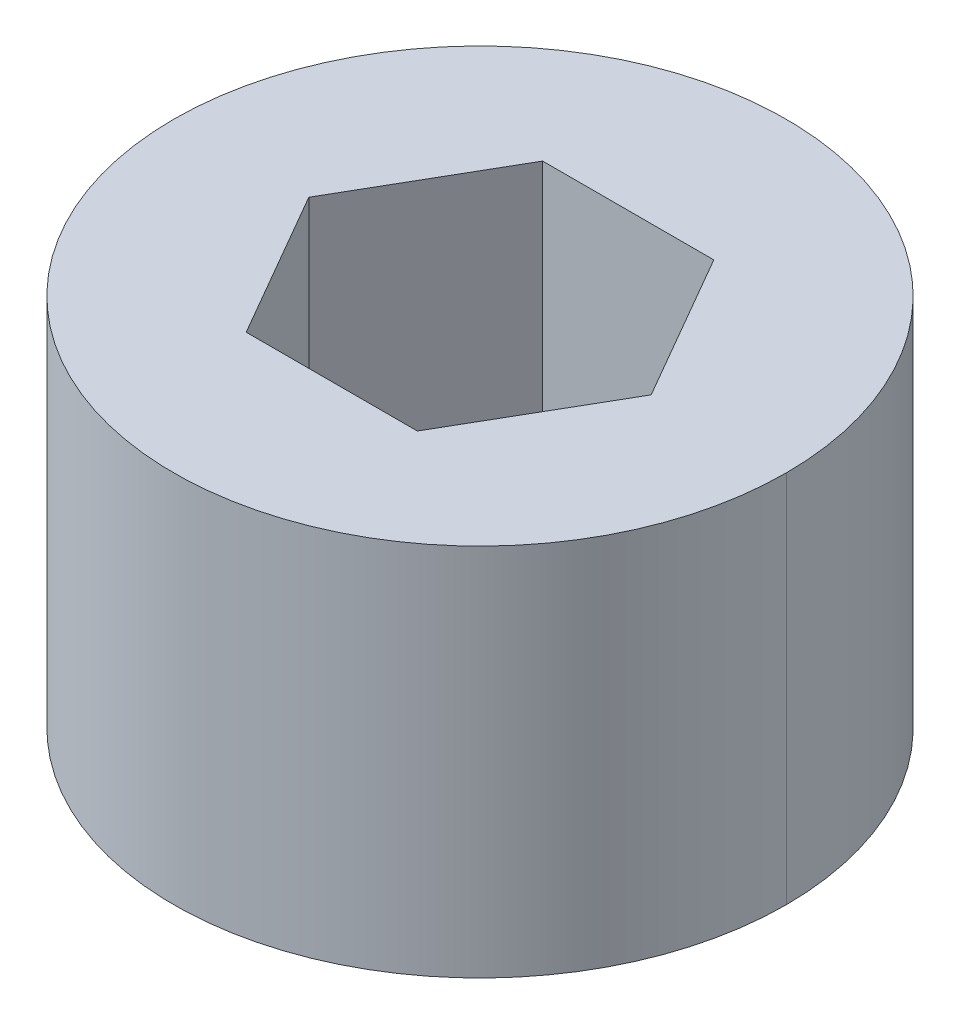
ISO-10303-21;
HEADER;
FILE_DESCRIPTION(('STEP AP214'),'2;1');
FILE_NAME('part.step','',(''),(''),'','','');
FILE_SCHEMA(('AUTOMOTIVE_DESIGN { 1 0 10303 214 1 1 1 1 }'));
ENDSEC;
DATA;
#1=APPLICATION_CONTEXT('core data for automotive mechanical design processes');
#2=APPLICATION_PROTOCOL_DEFINITION('international standard','automotive_design',2000,#1);
#3=PRODUCT_CONTEXT('',#1,'mechanical');
#4=PRODUCT('Part','Part','',(#3));
#5=PRODUCT_RELATED_PRODUCT_CATEGORY('part','',(#4));
#6=PRODUCT_DEFINITION_FORMATION('','',#4);
#7=PRODUCT_DEFINITION_CONTEXT('part definition',#1,'design');
#8=PRODUCT_DEFINITION('design','',#6,#7);
#9=PRODUCT_DEFINITION_SHAPE('','',#8);
#10=(LENGTH_UNIT() NAMED_UNIT(*) SI_UNIT(.MILLI.,.METRE.));
#11=(NAMED_UNIT(*) PLANE_ANGLE_UNIT() SI_UNIT($,.RADIAN.));
#12=(NAMED_UNIT(*) SI_UNIT($,.STERADIAN.) SOLID_ANGLE_UNIT());
#13=UNCERTAINTY_MEASURE_WITH_UNIT(LENGTH_MEASURE(1.E-05),#10,'distance_accuracy_value','');
#14=(GEOMETRIC_REPRESENTATION_CONTEXT(3) GLOBAL_UNCERTAINTY_ASSIGNED_CONTEXT((#13)) GLOBAL_UNIT_ASSIGNED_CONTEXT((#10,
#11,#12)) REPRESENTATION_CONTEXT('',''));
#15=CARTESIAN_POINT('',(0.,0.,0.));
#16=DIRECTION('',(0.,0.,1.));
#17=DIRECTION('',(1.,0.,0.));
#18=AXIS2_PLACEMENT_3D('',#15,#16,#17);
#19=CARTESIAN_POINT('',(-0.80197560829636,-0.78740000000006,-1.3890625));
#20=DIRECTION('',(-0.866025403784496,0.,-0.4999999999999));
#21=DIRECTION('',(-0.4999999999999,0.,0.866025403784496));
#22=AXIS2_PLACEMENT_3D('',#19,#20,#21);
#23=PLANE('',#22);
#24=DIRECTION('',(0.,1.,0.));
#25=VECTOR('',#24,1.);
#26=CARTESIAN_POINT('',(-1.60395121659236,-0.78740000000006,0.));
#27=LINE('',#26,#25);
#28=CARTESIAN_POINT('',(-1.60395121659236,1.75259999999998,0.));
#29=VERTEX_POINT('',#28);
#30=CARTESIAN_POINT('',(-1.60395121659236,-0.78740000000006,0.));
#31=VERTEX_POINT('',#30);
#32=EDGE_CURVE('E101',#29,#31,#27,.F.);
#33=ORIENTED_EDGE('',*,*,#32,.T.);
#34=DIRECTION('',(-0.4999999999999,0.,0.866025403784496));
#35=VECTOR('',#34,1.);
#36=CARTESIAN_POINT('',(-0.80197560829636,-0.78740000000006,-1.3890625));
#37=LINE('',#36,#35);
#38=CARTESIAN_POINT('',(-0.80197560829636,-0.78740000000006,-1.3890625));
#39=VERTEX_POINT('',#38);
#40=EDGE_CURVE('E90',#39,#31,#37,.T.);
#41=ORIENTED_EDGE('',*,*,#40,.F.);
#42=DIRECTION('',(0.,1.,0.));
#43=VECTOR('',#42,1.);
#44=CARTESIAN_POINT('',(-0.80197560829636,-0.78740000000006,-1.3890625));
#45=LINE('',#44,#43);
#46=CARTESIAN_POINT('',(-0.80197560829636,1.75259999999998,-1.3890625));
#47=VERTEX_POINT('',#46);
#48=EDGE_CURVE('E110',#39,#47,#45,.T.);
#49=ORIENTED_EDGE('',*,*,#48,.T.);
#50=DIRECTION('',(-0.4999999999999,0.,0.866025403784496));
#51=VECTOR('',#50,1.);
#52=CARTESIAN_POINT('',(-0.80197560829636,1.75259999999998,-1.3890625));
#53=LINE('',#52,#51);
#54=EDGE_CURVE('E85',#29,#47,#53,.F.);
#55=ORIENTED_EDGE('',*,*,#54,.F.);
#56=EDGE_LOOP('',(#33,#41,#49,#55));
#57=FACE_BOUND('',#56,.T.);
#58=ADVANCED_FACE('F16',(#57),#23,.F.);
#59=CARTESIAN_POINT('',(-1.60395121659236,-0.78740000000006,0.));
#60=DIRECTION('',(-0.866025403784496,0.,0.4999999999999));
#61=DIRECTION('',(0.4999999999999,0.,0.866025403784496));
#62=AXIS2_PLACEMENT_3D('',#59,#60,#61);
#63=PLANE('',#62);
#64=DIRECTION('',(0.,1.,0.));
#65=VECTOR('',#64,1.);
#66=CARTESIAN_POINT('',(-0.80197560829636,-0.78740000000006,1.3890625));
#67=LINE('',#66,#65);
#68=CARTESIAN_POINT('',(-0.80197560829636,1.75259999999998,1.3890625));
#69=VERTEX_POINT('',#68);
#70=CARTESIAN_POINT('',(-0.80197560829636,-0.78740000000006,1.3890625));
#71=VERTEX_POINT('',#70);
#72=EDGE_CURVE('E106',#69,#71,#67,.F.);
#73=ORIENTED_EDGE('',*,*,#72,.T.);
#74=DIRECTION('',(0.4999999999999,0.,0.866025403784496));
#75=VECTOR('',#74,1.);
#76=CARTESIAN_POINT('',(-1.60395121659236,-0.78740000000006,0.));
#77=LINE('',#76,#75);
#78=EDGE_CURVE('E94',#31,#71,#77,.T.);
#79=ORIENTED_EDGE('',*,*,#78,.F.);
#80=ORIENTED_EDGE('',*,*,#32,.F.);
#81=DIRECTION('',(0.4999999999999,0.,0.866025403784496));
#82=VECTOR('',#81,1.);
#83=CARTESIAN_POINT('',(-1.60395121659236,1.75259999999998,0.));
#84=LINE('',#83,#82);
#85=EDGE_CURVE('E108',#69,#29,#84,.F.);
#86=ORIENTED_EDGE('',*,*,#85,.F.);
#87=EDGE_LOOP('',(#73,#79,#80,#86));
#88=FACE_BOUND('',#87,.T.);
#89=ADVANCED_FACE('F104',(#88),#63,.F.);
#90=CARTESIAN_POINT('',(0.801975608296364,-0.78740000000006,-1.3890625));
#91=DIRECTION('',(0.,0.,-1.));
#92=DIRECTION('',(-1.,0.,0.));
#93=AXIS2_PLACEMENT_3D('',#90,#91,#92);
#94=PLANE('',#93);
#95=ORIENTED_EDGE('',*,*,#48,.F.);
#96=DIRECTION('',(1.,0.,0.));
#97=VECTOR('',#96,1.);
#98=CARTESIAN_POINT('',(0.,-0.78740000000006,-1.3890625));
#99=LINE('',#98,#97);
#100=CARTESIAN_POINT('',(0.801975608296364,-0.78740000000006,-1.3890625));
#101=VERTEX_POINT('',#100);
#102=EDGE_CURVE('E97',#39,#101,#99,.T.);
#103=ORIENTED_EDGE('',*,*,#102,.T.);
#104=DIRECTION('',(0.,1.,0.));
#105=VECTOR('',#104,1.);
#106=CARTESIAN_POINT('',(0.801975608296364,-0.78740000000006,-1.3890625));
#107=LINE('',#106,#105);
#108=CARTESIAN_POINT('',(0.801975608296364,1.75259999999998,-1.3890625));
#109=VERTEX_POINT('',#108);
#110=EDGE_CURVE('E133',#101,#109,#107,.T.);
#111=ORIENTED_EDGE('',*,*,#110,.T.);
#112=DIRECTION('',(-1.,0.,0.));
#113=VECTOR('',#112,1.);
#114=CARTESIAN_POINT('',(0.801975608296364,1.75259999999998,-1.3890625));
#115=LINE('',#114,#113);
#116=EDGE_CURVE('E144',#47,#109,#115,.F.);
#117=ORIENTED_EDGE('',*,*,#116,.F.);
#118=EDGE_LOOP('',(#95,#103,#111,#117));
#119=FACE_BOUND('',#118,.T.);
#120=ADVANCED_FACE('F147',(#119),#94,.F.);
#121=CARTESIAN_POINT('',(-0.80197560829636,-0.78740000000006,1.3890625));
#122=DIRECTION('',(0.,0.,1.));
#123=DIRECTION('',(1.,0.,0.));
#124=AXIS2_PLACEMENT_3D('',#121,#122,#123);
#125=PLANE('',#124);
#126=DIRECTION('',(0.,1.,0.));
#127=VECTOR('',#126,1.);
#128=CARTESIAN_POINT('',(0.801975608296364,-0.78740000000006,1.3890625));
#129=LINE('',#128,#127);
#130=CARTESIAN_POINT('',(0.801975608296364,1.75259999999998,1.3890625));
#131=VERTEX_POINT('',#130);
#132=CARTESIAN_POINT('',(0.801975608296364,-0.78740000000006,1.3890625));
#133=VERTEX_POINT('',#132);
#134=EDGE_CURVE('E130',#131,#133,#129,.F.);
#135=ORIENTED_EDGE('',*,*,#134,.T.);
#136=DIRECTION('',(1.,0.,0.));
#137=VECTOR('',#136,1.);
#138=CARTESIAN_POINT('',(0.,-0.78740000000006,1.3890625));
#139=LINE('',#138,#137);
#140=EDGE_CURVE('E138',#133,#71,#139,.F.);
#141=ORIENTED_EDGE('',*,*,#140,.T.);
#142=ORIENTED_EDGE('',*,*,#72,.F.);
#143=DIRECTION('',(1.,0.,0.));
#144=VECTOR('',#143,1.);
#145=CARTESIAN_POINT('',(-0.80197560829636,1.75259999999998,1.3890625));
#146=LINE('',#145,#144);
#147=EDGE_CURVE('E141',#131,#69,#146,.F.);
#148=ORIENTED_EDGE('',*,*,#147,.F.);
#149=EDGE_LOOP('',(#135,#141,#142,#148));
#150=FACE_BOUND('',#149,.T.);
#151=ADVANCED_FACE('F152',(#150),#125,.F.);
#152=CARTESIAN_POINT('',(0.,-0.78740000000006,0.));
#153=DIRECTION('',(0.,-1.,0.));
#154=DIRECTION('',(0.,0.,-1.));
#155=AXIS2_PLACEMENT_3D('',#152,#153,#154);
#156=PLANE('',#155);
#157=ORIENTED_EDGE('',*,*,#140,.F.);
#158=DIRECTION('',(0.4999999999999,0.,-0.866025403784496));
#159=VECTOR('',#158,1.);
#160=CARTESIAN_POINT('',(0.801975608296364,-0.78740000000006,1.3890625));
#161=LINE('',#160,#159);
#162=CARTESIAN_POINT('',(1.60395121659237,-0.78740000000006,0.));
#163=VERTEX_POINT('',#162);
#164=EDGE_CURVE('E128',#133,#163,#161,.T.);
#165=ORIENTED_EDGE('',*,*,#164,.T.);
#166=DIRECTION('',(-0.4999999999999,0.,-0.866025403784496));
#167=VECTOR('',#166,1.);
#168=CARTESIAN_POINT('',(1.60395121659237,-0.78740000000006,0.));
#169=LINE('',#168,#167);
#170=EDGE_CURVE('E136',#163,#101,#169,.T.);
#171=ORIENTED_EDGE('',*,*,#170,.T.);
#172=ORIENTED_EDGE('',*,*,#102,.F.);
#173=ORIENTED_EDGE('',*,*,#40,.T.);
#174=ORIENTED_EDGE('',*,*,#78,.T.);
#175=EDGE_LOOP('',(#157,#165,#171,#172,#173,#174));
#176=FACE_BOUND('',#175,.T.);
#177=ADVANCED_FACE('F92',(#176),#156,.F.);
#178=CARTESIAN_POINT('',(1.60395121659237,-0.78740000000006,0.));
#179=DIRECTION('',(0.866025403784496,0.,-0.4999999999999));
#180=DIRECTION('',(-0.4999999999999,0.,-0.866025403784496));
#181=AXIS2_PLACEMENT_3D('',#178,#179,#180);
#182=PLANE('',#181);
#183=ORIENTED_EDGE('',*,*,#110,.F.);
#184=ORIENTED_EDGE('',*,*,#170,.F.);
#185=DIRECTION('',(0.,1.,0.));
#186=VECTOR('',#185,1.);
#187=CARTESIAN_POINT('',(1.60395121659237,-0.78740000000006,0.));
#188=LINE('',#187,#186);
#189=CARTESIAN_POINT('',(1.60395121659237,1.75259999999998,0.));
#190=VERTEX_POINT('',#189);
#191=EDGE_CURVE('E123',#163,#190,#188,.T.);
#192=ORIENTED_EDGE('',*,*,#191,.T.);
#193=DIRECTION('',(-0.4999999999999,0.,-0.866025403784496));
#194=VECTOR('',#193,1.);
#195=CARTESIAN_POINT('',(1.60395121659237,1.75259999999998,0.));
#196=LINE('',#195,#194);
#197=EDGE_CURVE('E53',#109,#190,#196,.F.);
#198=ORIENTED_EDGE('',*,*,#197,.F.);
#199=EDGE_LOOP('',(#183,#184,#192,#198));
#200=FACE_BOUND('',#199,.T.);
#201=ADVANCED_FACE('F159',(#200),#182,.F.);
#202=CARTESIAN_POINT('',(0.801975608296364,-0.78740000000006,1.3890625));
#203=DIRECTION('',(0.866025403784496,0.,0.4999999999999));
#204=DIRECTION('',(0.4999999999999,0.,-0.866025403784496));
#205=AXIS2_PLACEMENT_3D('',#202,#203,#204);
#206=PLANE('',#205);
#207=ORIENTED_EDGE('',*,*,#191,.F.);
#208=ORIENTED_EDGE('',*,*,#164,.F.);
#209=ORIENTED_EDGE('',*,*,#134,.F.);
#210=DIRECTION('',(-0.4999999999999,0.,0.866025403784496));
#211=VECTOR('',#210,1.);
#212=CARTESIAN_POINT('',(1.60395121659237,1.75259999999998,0.));
#213=LINE('',#212,#211);
#214=EDGE_CURVE('E117',#190,#131,#213,.T.);
#215=ORIENTED_EDGE('',*,*,#214,.F.);
#216=EDGE_LOOP('',(#207,#208,#209,#215));
#217=FACE_BOUND('',#216,.T.);
#218=ADVANCED_FACE('F157',(#217),#206,.F.);
#219=CARTESIAN_POINT('',(0.,-1.75259999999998,0.));
#220=DIRECTION('',(0.,-1.,0.));
#221=DIRECTION('',(0.,0.,-1.));
#222=AXIS2_PLACEMENT_3D('',#219,#220,#221);
#223=PLANE('',#222);
#224=CARTESIAN_POINT('',(0.,-1.75259999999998,0.));
#225=DIRECTION('',(0.,-1.,0.));
#226=DIRECTION('',(0.,0.,-1.));
#227=AXIS2_PLACEMENT_3D('',#224,#225,#226);
#228=CIRCLE('',#227,2.8702);
#229=CARTESIAN_POINT('',(2.8702,-1.75259999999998,0.));
#230=VERTEX_POINT('',#229);
#231=CARTESIAN_POINT('',(-2.8702,-1.75259999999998,0.));
#232=VERTEX_POINT('',#231);
#233=EDGE_CURVE('E115',#230,#232,#228,.F.);
#234=ORIENTED_EDGE('',*,*,#233,.F.);
#235=CARTESIAN_POINT('',(0.,-1.75259999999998,0.));
#236=DIRECTION('',(0.,-1.,0.));
#237=DIRECTION('',(0.,0.,-1.));
#238=AXIS2_PLACEMENT_3D('',#235,#236,#237);
#239=CIRCLE('',#238,2.8702);
#240=EDGE_CURVE('E19',#232,#230,#239,.F.);
#241=ORIENTED_EDGE('',*,*,#240,.F.);
#242=EDGE_LOOP('',(#234,#241));
#243=FACE_BOUND('',#242,.T.);
#244=ADVANCED_FACE('F167',(#243),#223,.T.);
#245=CARTESIAN_POINT('',(0.,0.,0.));
#246=DIRECTION('',(0.,-1.,0.));
#247=DIRECTION('',(0.,0.,-1.));
#248=AXIS2_PLACEMENT_3D('',#245,#246,#247);
#249=CYLINDRICAL_SURFACE('',#248,2.8702);
#250=DIRECTION('',(0.,-1.,0.));
#251=VECTOR('',#250,1.);
#252=CARTESIAN_POINT('',(-2.8702,0.,0.));
#253=LINE('',#252,#251);
#254=CARTESIAN_POINT('',(-2.8702,1.75259999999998,0.));
#255=VERTEX_POINT('',#254);
#256=EDGE_CURVE('E25',#232,#255,#253,.F.);
#257=ORIENTED_EDGE('',*,*,#256,.F.);
#258=ORIENTED_EDGE('',*,*,#240,.T.);
#259=DIRECTION('',(0.,-1.,0.));
#260=VECTOR('',#259,1.);
#261=CARTESIAN_POINT('',(2.8702,0.,0.));
#262=LINE('',#261,#260);
#263=CARTESIAN_POINT('',(2.8702,1.75259999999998,0.));
#264=VERTEX_POINT('',#263);
#265=EDGE_CURVE('E45',#264,#230,#262,.T.);
#266=ORIENTED_EDGE('',*,*,#265,.F.);
#267=CARTESIAN_POINT('',(0.,1.75259999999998,0.));
#268=DIRECTION('',(0.,-1.,0.));
#269=DIRECTION('',(0.,0.,-1.));
#270=AXIS2_PLACEMENT_3D('',#267,#268,#269);
#271=CIRCLE('',#270,2.8702);
#272=EDGE_CURVE('E34',#255,#264,#271,.F.);
#273=ORIENTED_EDGE('',*,*,#272,.F.);
#274=EDGE_LOOP('',(#257,#258,#266,#273));
#275=FACE_BOUND('',#274,.T.);
#276=ADVANCED_FACE('F177',(#275),#249,.T.);
#277=CARTESIAN_POINT('',(0.,1.75259999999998,0.));
#278=DIRECTION('',(0.,1.,0.));
#279=DIRECTION('',(0.,0.,1.));
#280=AXIS2_PLACEMENT_3D('',#277,#278,#279);
#281=PLANE('',#280);
#282=ORIENTED_EDGE('',*,*,#272,.T.);
#283=CARTESIAN_POINT('',(0.,1.75259999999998,0.));
#284=DIRECTION('',(0.,-1.,0.));
#285=DIRECTION('',(0.,0.,-1.));
#286=AXIS2_PLACEMENT_3D('',#283,#284,#285);
#287=CIRCLE('',#286,2.8702);
#288=EDGE_CURVE('E11',#255,#264,#287,.T.);
#289=ORIENTED_EDGE('',*,*,#288,.F.);
#290=EDGE_LOOP('',(#282,#289));
#291=FACE_BOUND('',#290,.T.);
#292=ORIENTED_EDGE('',*,*,#197,.T.);
#293=ORIENTED_EDGE('',*,*,#214,.T.);
#294=ORIENTED_EDGE('',*,*,#147,.T.);
#295=ORIENTED_EDGE('',*,*,#85,.T.);
#296=ORIENTED_EDGE('',*,*,#54,.T.);
#297=ORIENTED_EDGE('',*,*,#116,.T.);
#298=EDGE_LOOP('',(#292,#293,#294,#295,#296,#297));
#299=FACE_BOUND('',#298,.T.);
#300=ADVANCED_FACE('F149',(#291,#299),#281,.T.);
#301=CARTESIAN_POINT('',(0.,0.,0.));
#302=DIRECTION('',(0.,-1.,0.));
#303=DIRECTION('',(0.,0.,-1.));
#304=AXIS2_PLACEMENT_3D('',#301,#302,#303);
#305=CYLINDRICAL_SURFACE('',#304,2.8702);
#306=ORIENTED_EDGE('',*,*,#256,.T.);
#307=ORIENTED_EDGE('',*,*,#288,.T.);
#308=ORIENTED_EDGE('',*,*,#265,.T.);
#309=ORIENTED_EDGE('',*,*,#233,.T.);
#310=EDGE_LOOP('',(#306,#307,#308,#309));
#311=FACE_BOUND('',#310,.T.);
#312=ADVANCED_FACE('F170',(#311),#305,.T.);
#313=CLOSED_SHELL('',(#58,#89,#120,#151,#177,#201,#218,#244,#276,#300,#312));
#314=MANIFOLD_SOLID_BREP('B1',#313);
#315=ADVANCED_BREP_SHAPE_REPRESENTATION('',(#18,#314),#14);
#316=SHAPE_DEFINITION_REPRESENTATION(#9,#315);
ENDSEC;
END-ISO-10303-21;
